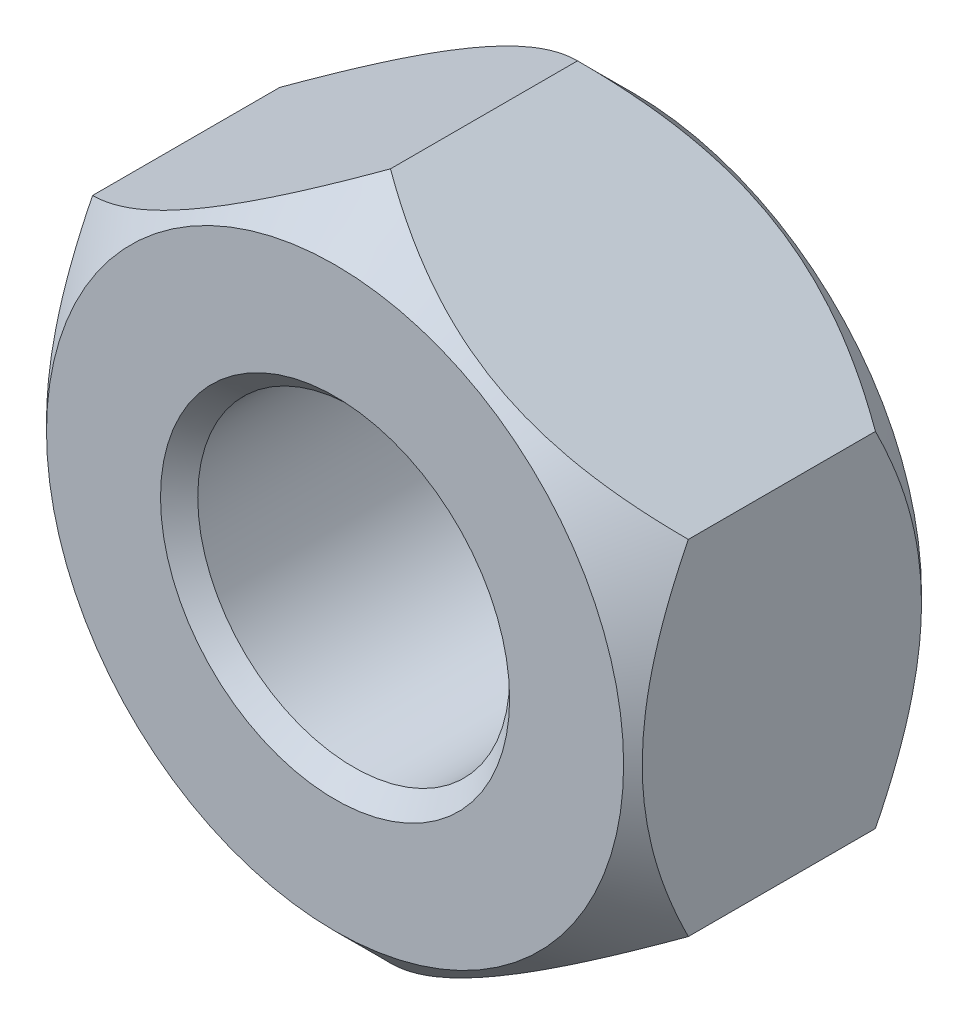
ISO-10303-21;
HEADER;
FILE_DESCRIPTION(('STEP AP214'),'2;1');
FILE_NAME('part.step','',(''),(''),'','','');
FILE_SCHEMA(('AUTOMOTIVE_DESIGN { 1 0 10303 214 1 1 1 1 }'));
ENDSEC;
DATA;
#1=APPLICATION_CONTEXT('core data for automotive mechanical design processes');
#2=APPLICATION_PROTOCOL_DEFINITION('international standard','automotive_design',2000,#1);
#3=PRODUCT_CONTEXT('',#1,'mechanical');
#4=PRODUCT('Part','Part','',(#3));
#5=PRODUCT_RELATED_PRODUCT_CATEGORY('part','',(#4));
#6=PRODUCT_DEFINITION_FORMATION('','',#4);
#7=PRODUCT_DEFINITION_CONTEXT('part definition',#1,'design');
#8=PRODUCT_DEFINITION('design','',#6,#7);
#9=PRODUCT_DEFINITION_SHAPE('','',#8);
#10=(LENGTH_UNIT() NAMED_UNIT(*) SI_UNIT(.MILLI.,.METRE.));
#11=(NAMED_UNIT(*) PLANE_ANGLE_UNIT() SI_UNIT($,.RADIAN.));
#12=(NAMED_UNIT(*) SI_UNIT($,.STERADIAN.) SOLID_ANGLE_UNIT());
#13=UNCERTAINTY_MEASURE_WITH_UNIT(LENGTH_MEASURE(1.E-05),#10,'distance_accuracy_value','');
#14=(GEOMETRIC_REPRESENTATION_CONTEXT(3) GLOBAL_UNCERTAINTY_ASSIGNED_CONTEXT((#13)) GLOBAL_UNIT_ASSIGNED_CONTEXT((#10,
#11,#12)) REPRESENTATION_CONTEXT('',''));
#15=CARTESIAN_POINT('',(0.,0.,0.));
#16=DIRECTION('',(0.,0.,1.));
#17=DIRECTION('',(1.,0.,0.));
#18=AXIS2_PLACEMENT_3D('',#15,#16,#17);
#19=CARTESIAN_POINT('',(0.,0.,-4.));
#20=DIRECTION('',(0.,0.,1.));
#21=DIRECTION('',(1.,0.,0.));
#22=AXIS2_PLACEMENT_3D('',#19,#20,#21);
#23=PLANE('',#22);
#24=CARTESIAN_POINT('',(0.,0.,-4.));
#25=DIRECTION('',(0.,0.,1.));
#26=DIRECTION('',(1.,0.,0.));
#27=AXIS2_PLACEMENT_3D('',#24,#25,#26);
#28=CIRCLE('',#27,4.68800000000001);
#29=CARTESIAN_POINT('',(4.68800000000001,0.,-4.));
#30=VERTEX_POINT('',#29);
#31=EDGE_CURVE('E147',#30,#30,#28,.T.);
#32=ORIENTED_EDGE('',*,*,#31,.T.);
#33=EDGE_LOOP('',(#32));
#34=FACE_BOUND('',#33,.T.);
#35=CARTESIAN_POINT('',(0.,0.,-4.));
#36=DIRECTION('',(0.,0.,1.));
#37=DIRECTION('',(1.,0.,0.));
#38=AXIS2_PLACEMENT_3D('',#35,#36,#37);
#39=CIRCLE('',#38,7.75);
#40=CARTESIAN_POINT('',(7.75,0.,-4.));
#41=VERTEX_POINT('',#40);
#42=EDGE_CURVE('E111',#41,#41,#39,.T.);
#43=ORIENTED_EDGE('',*,*,#42,.F.);
#44=EDGE_LOOP('',(#43));
#45=FACE_BOUND('',#44,.T.);
#46=ADVANCED_FACE('F51',(#34,#45),#23,.F.);
#47=CARTESIAN_POINT('',(0.,0.,4.));
#48=DIRECTION('',(0.,0.,1.));
#49=DIRECTION('',(1.,0.,0.));
#50=AXIS2_PLACEMENT_3D('',#47,#48,#49);
#51=PLANE('',#50);
#52=CARTESIAN_POINT('',(0.,0.,4.));
#53=DIRECTION('',(0.,0.,1.));
#54=DIRECTION('',(1.,0.,0.));
#55=AXIS2_PLACEMENT_3D('',#52,#53,#54);
#56=CIRCLE('',#55,4.688);
#57=CARTESIAN_POINT('',(4.688,0.,4.));
#58=VERTEX_POINT('',#57);
#59=EDGE_CURVE('E12',#58,#58,#56,.F.);
#60=ORIENTED_EDGE('',*,*,#59,.T.);
#61=EDGE_LOOP('',(#60));
#62=FACE_BOUND('',#61,.T.);
#63=CARTESIAN_POINT('',(0.,0.,4.));
#64=DIRECTION('',(0.,0.,1.));
#65=DIRECTION('',(1.,0.,0.));
#66=AXIS2_PLACEMENT_3D('',#63,#64,#65);
#67=CIRCLE('',#66,7.75);
#68=CARTESIAN_POINT('',(7.75,0.,4.));
#69=VERTEX_POINT('',#68);
#70=EDGE_CURVE('E231',#69,#69,#67,.T.);
#71=ORIENTED_EDGE('',*,*,#70,.T.);
#72=EDGE_LOOP('',(#71));
#73=FACE_BOUND('',#72,.T.);
#74=ADVANCED_FACE('F235',(#62,#73),#51,.T.);
#75=CARTESIAN_POINT('',(0.,9.23760430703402,4.));
#76=DIRECTION('',(0.5,-0.866025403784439,0.));
#77=DIRECTION('',(0.866025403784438,0.5,0.));
#78=AXIS2_PLACEMENT_3D('',#75,#76,#77);
#79=PLANE('',#78);
#80=DIRECTION('',(0.,0.,-1.));
#81=VECTOR('',#80,1.);
#82=CARTESIAN_POINT('',(0.,9.23760430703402,4.));
#83=LINE('',#82,#81);
#84=CARTESIAN_POINT('',(0.,9.23760430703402,2.51239569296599));
#85=VERTEX_POINT('',#84);
#86=CARTESIAN_POINT('',(0.,9.23760430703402,-2.51239569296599));
#87=VERTEX_POINT('',#86);
#88=EDGE_CURVE('E124',#85,#87,#83,.T.);
#89=ORIENTED_EDGE('',*,*,#88,.T.);
#90=CARTESIAN_POINT('',(0.000200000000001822,9.23771977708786,-2.51228022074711));
#91=CARTESIAN_POINT('',(-0.137352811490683,9.15830362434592,-2.59168743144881));
#92=CARTESIAN_POINT('',(-0.275962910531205,9.07827704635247,-2.66865771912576));
#93=CARTESIAN_POINT('',(-0.555505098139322,8.91688328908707,-2.81698316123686));
#94=CARTESIAN_POINT('',(-0.696438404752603,8.83551540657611,-2.88833524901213));
#95=CARTESIAN_POINT('',(-1.12434348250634,8.58846429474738,-3.09346070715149));
#96=CARTESIAN_POINT('',(-1.41493761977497,8.42068969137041,-3.21742824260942));
#97=CARTESIAN_POINT('',(-2.00094388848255,8.08235881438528,-3.42971394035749));
#98=CARTESIAN_POINT('',(-2.29620625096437,7.91188900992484,-3.5185669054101));
#99=CARTESIAN_POINT('',(-2.74395385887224,7.65338180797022,-3.62134783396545));
#100=CARTESIAN_POINT('',(-2.89386225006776,7.5668321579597,-3.65051131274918));
#101=CARTESIAN_POINT('',(-3.19494827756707,7.39300005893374,-3.69801217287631));
#102=CARTESIAN_POINT('',(-3.34612572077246,7.30571772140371,-3.71635117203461));
#103=CARTESIAN_POINT('',(-3.7145273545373,7.09302093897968,-3.7470993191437));
#104=CARTESIAN_POINT('',(-3.93214848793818,6.96737731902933,-3.75355065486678));
#105=CARTESIAN_POINT('',(-4.36699849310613,6.7163165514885,-3.74272107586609));
#106=CARTESIAN_POINT('',(-4.58422720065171,6.59089949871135,-3.72543184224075));
#107=CARTESIAN_POINT('',(-5.01663658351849,6.34124782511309,-3.66814025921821));
#108=CARTESIAN_POINT('',(-5.23181469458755,6.21701468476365,-3.62811251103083));
#109=CARTESIAN_POINT('',(-5.65847251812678,5.97068367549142,-3.52752005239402));
#110=CARTESIAN_POINT('',(-5.86995251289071,5.84858564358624,-3.46695691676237));
#111=CARTESIAN_POINT('',(-6.24536139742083,5.6318432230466,-3.34236205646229));
#112=CARTESIAN_POINT('',(-6.41012167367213,5.53671883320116,-3.28160757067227));
#113=CARTESIAN_POINT('',(-6.7366846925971,5.34817758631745,-3.15030853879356));
#114=CARTESIAN_POINT('',(-6.89848734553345,5.25476078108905,-3.07976369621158));
#115=CARTESIAN_POINT('',(-7.21862548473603,5.06992894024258,-2.93046522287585));
#116=CARTESIAN_POINT('',(-7.37697007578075,4.97850864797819,-2.85173740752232));
#117=CARTESIAN_POINT('',(-7.69072726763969,4.79736084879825,-2.68710651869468));
#118=CARTESIAN_POINT('',(-7.84614159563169,4.70763234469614,-2.6012078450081));
#119=CARTESIAN_POINT('',(-8.00020000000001,4.61868668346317,-2.51228022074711));
#120=B_SPLINE_CURVE_WITH_KNOTS('',3,(#90,#91,#92,#93,#94,#95,#96,#97,#98,#99,#100,#101,#102,
#103,#104,#105,#106,#107,#108,#109,#110,#111,#112,#113,#114,#115,#116,#117,#118,#119),
.UNSPECIFIED.,.F.,.F.,(4,2,2,2,2,2,2,2,2,2,2,2,2,2,4),(0.,0.532696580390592,1.06568194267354,
2.13740664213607,3.19211397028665,3.71843331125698,4.24467396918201,4.99761238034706,
5.75081469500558,6.50485999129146,7.25884747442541,7.85770857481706,8.45658781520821,
9.05363199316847,9.65031250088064),.UNSPECIFIED.);
#121=CARTESIAN_POINT('',(-8.00000000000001,4.61880215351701,-2.51239569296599));
#122=VERTEX_POINT('',#121);
#123=EDGE_CURVE('E67',#87,#122,#120,.T.);
#124=ORIENTED_EDGE('',*,*,#123,.T.);
#125=DIRECTION('',(0.,0.,-1.));
#126=VECTOR('',#125,1.);
#127=CARTESIAN_POINT('',(-8.00000000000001,4.61880215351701,4.));
#128=LINE('',#127,#126);
#129=CARTESIAN_POINT('',(-8.00000000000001,4.61880215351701,2.51239569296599));
#130=VERTEX_POINT('',#129);
#131=EDGE_CURVE('E137',#130,#122,#128,.T.);
#132=ORIENTED_EDGE('',*,*,#131,.F.);
#133=CARTESIAN_POINT('',(0.000200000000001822,9.23771977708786,2.51228022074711));
#134=CARTESIAN_POINT('',(-0.137352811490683,9.15830362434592,2.59168743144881));
#135=CARTESIAN_POINT('',(-0.275962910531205,9.07827704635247,2.66865771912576));
#136=CARTESIAN_POINT('',(-0.555505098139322,8.91688328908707,2.81698316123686));
#137=CARTESIAN_POINT('',(-0.696438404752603,8.83551540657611,2.88833524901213));
#138=CARTESIAN_POINT('',(-1.12434348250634,8.58846429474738,3.09346070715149));
#139=CARTESIAN_POINT('',(-1.41493761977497,8.42068969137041,3.21742824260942));
#140=CARTESIAN_POINT('',(-2.00094388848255,8.08235881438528,3.42971394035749));
#141=CARTESIAN_POINT('',(-2.29620625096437,7.91188900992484,3.5185669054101));
#142=CARTESIAN_POINT('',(-2.74395385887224,7.65338180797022,3.62134783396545));
#143=CARTESIAN_POINT('',(-2.89386225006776,7.5668321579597,3.65051131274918));
#144=CARTESIAN_POINT('',(-3.19494827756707,7.39300005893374,3.69801217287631));
#145=CARTESIAN_POINT('',(-3.34612572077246,7.30571772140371,3.71635117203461));
#146=CARTESIAN_POINT('',(-3.7145273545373,7.09302093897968,3.7470993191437));
#147=CARTESIAN_POINT('',(-3.93214848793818,6.96737731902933,3.75355065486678));
#148=CARTESIAN_POINT('',(-4.36699849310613,6.7163165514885,3.74272107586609));
#149=CARTESIAN_POINT('',(-4.58422720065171,6.59089949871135,3.72543184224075));
#150=CARTESIAN_POINT('',(-5.01663658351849,6.34124782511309,3.66814025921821));
#151=CARTESIAN_POINT('',(-5.23181469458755,6.21701468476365,3.62811251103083));
#152=CARTESIAN_POINT('',(-5.65847251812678,5.97068367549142,3.52752005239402));
#153=CARTESIAN_POINT('',(-5.86995251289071,5.84858564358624,3.46695691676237));
#154=CARTESIAN_POINT('',(-6.24536139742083,5.6318432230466,3.34236205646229));
#155=CARTESIAN_POINT('',(-6.41012167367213,5.53671883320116,3.28160757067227));
#156=CARTESIAN_POINT('',(-6.7366846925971,5.34817758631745,3.15030853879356));
#157=CARTESIAN_POINT('',(-6.89848734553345,5.25476078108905,3.07976369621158));
#158=CARTESIAN_POINT('',(-7.21862548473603,5.06992894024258,2.93046522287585));
#159=CARTESIAN_POINT('',(-7.37697007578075,4.97850864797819,2.85173740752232));
#160=CARTESIAN_POINT('',(-7.69072726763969,4.79736084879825,2.68710651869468));
#161=CARTESIAN_POINT('',(-7.84614159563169,4.70763234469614,2.6012078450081));
#162=CARTESIAN_POINT('',(-8.00020000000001,4.61868668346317,2.51228022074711));
#163=B_SPLINE_CURVE_WITH_KNOTS('',3,(#133,#134,#135,#136,#137,#138,#139,#140,#141,#142,#143,
#144,#145,#146,#147,#148,#149,#150,#151,#152,#153,#154,#155,#156,#157,#158,#159,#160,#161,#162),
.UNSPECIFIED.,.F.,.F.,(4,2,2,2,2,2,2,2,2,2,2,2,2,2,4),(0.,0.532696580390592,1.06568194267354,
2.13740664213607,3.19211397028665,3.71843331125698,4.24467396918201,4.99761238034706,
5.75081469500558,6.50485999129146,7.25884747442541,7.85770857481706,8.45658781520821,
9.05363199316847,9.65031250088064),.UNSPECIFIED.);
#164=EDGE_CURVE('E128',#85,#130,#163,.T.);
#165=ORIENTED_EDGE('',*,*,#164,.F.);
#166=EDGE_LOOP('',(#89,#124,#132,#165));
#167=FACE_BOUND('',#166,.T.);
#168=ADVANCED_FACE('F232',(#167),#79,.F.);
#169=CARTESIAN_POINT('',(-8.00000000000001,4.61880215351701,4.));
#170=DIRECTION('',(1.,0.,0.));
#171=DIRECTION('',(0.,0.,-1.));
#172=AXIS2_PLACEMENT_3D('',#169,#170,#171);
#173=PLANE('',#172);
#174=ORIENTED_EDGE('',*,*,#131,.T.);
#175=CARTESIAN_POINT('',(-8.00000000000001,16.677021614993,6.74656859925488));
#176=CARTESIAN_POINT('',(-8.00000000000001,16.4339140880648,6.52737969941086));
#177=CARTESIAN_POINT('',(-8.00000000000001,16.1903653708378,6.30868106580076));
#178=CARTESIAN_POINT('',(-8.00000000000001,15.7022653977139,5.87240492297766));
#179=CARTESIAN_POINT('',(-8.00000000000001,15.4577141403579,5.65482741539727));
#180=CARTESIAN_POINT('',(-8.00000000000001,14.7222298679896,5.00385786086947));
#181=CARTESIAN_POINT('',(-8.00000000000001,14.2296125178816,4.57236086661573));
#182=CARTESIAN_POINT('',(-8.00000000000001,13.4838633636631,3.9279720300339));
#183=CARTESIAN_POINT('',(-8.00000000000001,13.232881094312,3.71259088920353));
#184=CARTESIAN_POINT('',(-8.00000000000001,12.7292285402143,3.28382097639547));
#185=CARTESIAN_POINT('',(-8.00000000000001,12.4765582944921,3.07043215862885));
#186=CARTESIAN_POINT('',(-8.00000000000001,11.969320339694,2.64601838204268));
#187=CARTESIAN_POINT('',(-8.00000000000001,11.7147530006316,2.43499298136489));
#188=CARTESIAN_POINT('',(-8.00000000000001,11.2033461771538,2.01566479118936));
#189=CARTESIAN_POINT('',(-8.00000000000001,10.9465064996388,1.80736223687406));
#190=CARTESIAN_POINT('',(-8.00000000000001,10.4555553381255,1.41431471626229));
#191=CARTESIAN_POINT('',(-8.00000000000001,10.221688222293,1.22926479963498));
#192=CARTESIAN_POINT('',(-8.00000000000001,9.75150464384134,0.862304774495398));
#193=CARTESIAN_POINT('',(-8.00000000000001,9.51518821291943,0.680394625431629));
#194=CARTESIAN_POINT('',(-8.00000000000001,9.03974665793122,0.320332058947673));
#195=CARTESIAN_POINT('',(-8.00000000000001,8.80062185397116,0.142179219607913));
#196=CARTESIAN_POINT('',(-8.00000000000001,8.3190909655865,-0.209625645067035));
#197=CARTESIAN_POINT('',(-8.00000000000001,8.07668501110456,-0.383277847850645));
#198=CARTESIAN_POINT('',(-8.00000000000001,7.58855538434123,-0.724764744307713));
#199=CARTESIAN_POINT('',(-8.00000000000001,7.34283973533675,-0.892610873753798));
#200=CARTESIAN_POINT('',(-8.00000000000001,6.84695249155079,-1.22164145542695));
#201=CARTESIAN_POINT('',(-8.00000000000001,6.59678066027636,-1.3828255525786));
#202=CARTESIAN_POINT('',(-8.00000000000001,6.09146673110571,-1.6968017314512));
#203=CARTESIAN_POINT('',(-8.00000000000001,5.8363285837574,-1.84960014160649));
#204=CARTESIAN_POINT('',(-8.00000000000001,5.32014433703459,-2.14483941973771));
#205=CARTESIAN_POINT('',(-8.00000000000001,5.05909922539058,-2.28728200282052));
#206=CARTESIAN_POINT('',(-8.00000000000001,4.54613837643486,-2.55098167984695));
#207=CARTESIAN_POINT('',(-8.00000000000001,4.29461515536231,-2.6729972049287));
#208=CARTESIAN_POINT('',(-8.00000000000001,3.78502505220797,-2.90270124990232));
#209=CARTESIAN_POINT('',(-8.00000000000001,3.52695772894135,-3.01038880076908));
#210=CARTESIAN_POINT('',(-8.00000000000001,3.00465775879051,-3.20777100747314));
#211=CARTESIAN_POINT('',(-8.00000000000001,2.74044127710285,-3.2975079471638));
#212=CARTESIAN_POINT('',(-8.00000000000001,2.20566966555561,-3.45543221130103));
#213=CARTESIAN_POINT('',(-8.00000000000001,1.93511771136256,-3.52363009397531));
#214=CARTESIAN_POINT('',(-8.00000000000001,1.43173596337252,-3.62602007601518));
#215=CARTESIAN_POINT('',(-8.00000000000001,1.19965471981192,-3.66387063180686));
#216=CARTESIAN_POINT('',(-8.00000000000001,0.733117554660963,-3.71981438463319));
#217=CARTESIAN_POINT('',(-8.00000000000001,0.498662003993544,-3.73791062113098));
#218=CARTESIAN_POINT('',(-8.00000000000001,0.0293362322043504,-3.75337981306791));
#219=CARTESIAN_POINT('',(-8.00000000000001,-0.20553316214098,-3.75077743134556));
#220=CARTESIAN_POINT('',(-8.00000000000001,-0.674150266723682,-3.72505822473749));
#221=CARTESIAN_POINT('',(-8.00000000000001,-0.907897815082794,-3.70193852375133));
#222=CARTESIAN_POINT('',(-8.00000000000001,-1.43154362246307,-3.62803927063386));
#223=CARTESIAN_POINT('',(-8.00000000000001,-1.72066391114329,-3.57173596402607));
#224=CARTESIAN_POINT('',(-8.00000000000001,-2.29243442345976,-3.43265983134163));
#225=CARTESIAN_POINT('',(-8.00000000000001,-2.57508184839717,-3.34987577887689));
#226=CARTESIAN_POINT('',(-8.00000000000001,-3.13438779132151,-3.16195065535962));
#227=CARTESIAN_POINT('',(-8.00000000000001,-3.41100765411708,-3.05669587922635));
#228=CARTESIAN_POINT('',(-8.00000000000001,-3.82023953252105,-2.88552645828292));
#229=CARTESIAN_POINT('',(-8.00000000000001,-3.95569575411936,-2.82625780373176));
#230=CARTESIAN_POINT('',(-8.00000000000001,-4.224803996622,-2.70375120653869));
#231=CARTESIAN_POINT('',(-8.00000000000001,-4.35845602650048,-2.64051328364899));
#232=CARTESIAN_POINT('',(-8.00000000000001,-4.70447797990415,-2.47112539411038));
#233=CARTESIAN_POINT('',(-8.00000000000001,-4.91548376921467,-2.36218803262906));
#234=CARTESIAN_POINT('',(-8.00000000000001,-5.3334340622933,-2.13675103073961));
#235=CARTESIAN_POINT('',(-8.00000000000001,-5.5403778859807,-2.02025013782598));
#236=CARTESIAN_POINT('',(-8.00000000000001,-5.95070781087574,-1.78089074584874));
#237=CARTESIAN_POINT('',(-8.00000000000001,-6.1540917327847,-1.65802852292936));
#238=CARTESIAN_POINT('',(-8.00000000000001,-6.55758851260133,-1.40703045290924));
#239=CARTESIAN_POINT('',(-8.00000000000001,-6.75770113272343,-1.27889422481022));
#240=CARTESIAN_POINT('',(-8.00000000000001,-7.15549781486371,-1.01787241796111));
#241=CARTESIAN_POINT('',(-8.00000000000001,-7.35317474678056,-0.884975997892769));
#242=CARTESIAN_POINT('',(-8.00000000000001,-7.7459392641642,-0.615404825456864));
#243=CARTESIAN_POINT('',(-8.00000000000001,-7.94102675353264,-0.478729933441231));
#244=CARTESIAN_POINT('',(-8.00000000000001,-8.52272092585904,-0.0639991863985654));
#245=CARTESIAN_POINT('',(-8.00000000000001,-8.90590512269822,0.218859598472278));
#246=CARTESIAN_POINT('',(-8.00000000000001,-9.66681344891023,0.795337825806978));
#247=CARTESIAN_POINT('',(-8.00000000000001,-10.0445044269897,1.08900071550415));
#248=CARTESIAN_POINT('',(-8.00000000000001,-10.7941449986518,1.68359546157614));
#249=CARTESIAN_POINT('',(-8.00000000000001,-11.1660942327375,1.98452777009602));
#250=CARTESIAN_POINT('',(-8.00000000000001,-11.9048648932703,2.59160363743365));
#251=CARTESIAN_POINT('',(-8.00000000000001,-12.2716925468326,2.89773963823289));
#252=CARTESIAN_POINT('',(-8.00000000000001,-13.0015844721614,3.51444067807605));
#253=CARTESIAN_POINT('',(-8.00000000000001,-13.3646488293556,3.82500561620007));
#254=CARTESIAN_POINT('',(-8.00000000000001,-14.2245738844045,4.56794628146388));
#255=CARTESIAN_POINT('',(-8.00000000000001,-14.7200495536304,5.00192429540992));
#256=CARTESIAN_POINT('',(-8.00000000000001,-15.458283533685,5.65533325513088));
#257=CARTESIAN_POINT('',(-8.00000000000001,-15.7027522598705,5.87283891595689));
#258=CARTESIAN_POINT('',(-8.00000000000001,-16.1906346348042,6.30892291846));
#259=CARTESIAN_POINT('',(-8.00000000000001,-16.4340485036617,6.52750101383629));
#260=CARTESIAN_POINT('',(-8.00000000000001,-16.677021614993,6.74656859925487));
#261=B_SPLINE_CURVE_WITH_KNOTS('',3,(#175,#176,#177,#178,#179,#180,#181,#182,#183,#184,#185,
#186,#187,#188,#189,#190,#191,#192,#193,#194,#195,#196,#197,#198,#199,#200,#201,#202,#203,#204,
#205,#206,#207,#208,#209,#210,#211,#212,#213,#214,#215,#216,#217,#218,#219,#220,#221,#222,#223,
#224,#225,#226,#227,#228,#229,#230,#231,#232,#233,#234,#235,#236,#237,#238,#239,#240,#241,#242,
#243,#244,#245,#246,#247,#248,#249,#250,#251,#252,#253,#254,#255,#256,#257,#258,#259,#260),
.UNSPECIFIED.,.F.,.F.,(4,2,2,2,2,2,2,2,2,2,2,2,2,2,2,2,2,2,2,2,2,2,2,2,2,2,2,2,2,2,2,2,2,2,2,2,
2,2,2,2,2,2,4),(0.,0.98198814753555,1.96397772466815,3.92854786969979,4.92072454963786,
5.9128783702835,6.90484349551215,7.89689374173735,8.79154219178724,9.68617907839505,
10.5807149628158,11.4752155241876,12.3678403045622,13.2605125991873,14.1525016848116,
15.044342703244,15.8826525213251,16.7210190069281,17.5573867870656,18.393343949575,
19.0980187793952,19.802585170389,20.5063121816,21.2101378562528,22.0922820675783,
22.9748007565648,23.8618956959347,24.305411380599,24.7489248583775,25.4611294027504,
26.1734521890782,26.8861967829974,27.5989929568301,28.313531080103,29.0280956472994,
30.4566999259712,31.8918641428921,33.3271178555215,34.7604400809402,36.193729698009,
38.1696568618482,39.1513179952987,40.1327633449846),.UNSPECIFIED.);
#262=CARTESIAN_POINT('',(-8.00000000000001,-4.61880215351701,-2.51239569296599));
#263=VERTEX_POINT('',#262);
#264=EDGE_CURVE('E216',#122,#263,#261,.T.);
#265=ORIENTED_EDGE('',*,*,#264,.T.);
#266=DIRECTION('',(0.,0.,-1.));
#267=VECTOR('',#266,1.);
#268=CARTESIAN_POINT('',(-8.00000000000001,-4.61880215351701,4.));
#269=LINE('',#268,#267);
#270=CARTESIAN_POINT('',(-8.00000000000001,-4.61880215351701,2.51239569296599));
#271=VERTEX_POINT('',#270);
#272=EDGE_CURVE('E134',#271,#263,#269,.T.);
#273=ORIENTED_EDGE('',*,*,#272,.F.);
#274=CARTESIAN_POINT('',(-8.00000000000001,16.6323065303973,-6.70626236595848));
#275=CARTESIAN_POINT('',(-8.00000000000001,16.3898767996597,-6.48779457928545));
#276=CARTESIAN_POINT('',(-8.00000000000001,16.1470054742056,-6.26981775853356));
#277=CARTESIAN_POINT('',(-8.00000000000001,15.6602594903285,-5.8349867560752));
#278=CARTESIAN_POINT('',(-8.00000000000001,15.4163848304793,-5.61813257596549));
#279=CARTESIAN_POINT('',(-8.00000000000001,14.6829283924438,-4.96933482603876));
#280=CARTESIAN_POINT('',(-8.00000000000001,14.1916610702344,-4.53928874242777));
#281=CARTESIAN_POINT('',(-8.00000000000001,13.4479083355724,-3.89706020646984));
#282=CARTESIAN_POINT('',(-8.00000000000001,13.1975731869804,-3.68238591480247));
#283=CARTESIAN_POINT('',(-8.00000000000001,12.6952139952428,-3.25503230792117));
#284=CARTESIAN_POINT('',(-8.00000000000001,12.4431899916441,-3.04235294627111));
#285=CARTESIAN_POINT('',(-8.00000000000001,11.9372441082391,-2.61936111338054));
#286=CARTESIAN_POINT('',(-8.00000000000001,11.683322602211,-2.40904819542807));
#287=CARTESIAN_POINT('',(-8.00000000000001,11.1732067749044,-1.9911477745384));
#288=CARTESIAN_POINT('',(-8.00000000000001,10.9170122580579,-1.78356051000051));
#289=CARTESIAN_POINT('',(-8.00000000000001,10.4267508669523,-1.39144657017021));
#290=CARTESIAN_POINT('',(-8.00000000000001,10.1929234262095,-1.20662081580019));
#291=CARTESIAN_POINT('',(-8.00000000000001,9.7228076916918,-0.840127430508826));
#292=CARTESIAN_POINT('',(-8.00000000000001,9.48651943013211,-0.658459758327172));
#293=CARTESIAN_POINT('',(-8.00000000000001,9.01112097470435,-0.298905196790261));
#294=CARTESIAN_POINT('',(-8.00000000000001,8.77201110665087,-0.121017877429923));
#295=CARTESIAN_POINT('',(-8.00000000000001,8.2904943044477,0.230227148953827));
#296=CARTESIAN_POINT('',(-8.00000000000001,8.04808750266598,0.403585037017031));
#297=CARTESIAN_POINT('',(-8.00000000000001,7.55994843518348,0.744439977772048));
#298=CARTESIAN_POINT('',(-8.00000000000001,7.31422439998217,0.911948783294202));
#299=CARTESIAN_POINT('',(-8.00000000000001,6.8182995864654,1.24025896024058));
#300=CARTESIAN_POINT('',(-8.00000000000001,6.56809856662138,1.4010599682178));
#301=CARTESIAN_POINT('',(-8.00000000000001,6.06270653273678,1.71420953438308));
#302=CARTESIAN_POINT('',(-8.00000000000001,5.80751954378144,1.86656455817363));
#303=CARTESIAN_POINT('',(-8.00000000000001,5.29121549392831,2.16084138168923));
#304=CARTESIAN_POINT('',(-8.00000000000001,5.0300994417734,2.30276493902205));
#305=CARTESIAN_POINT('',(-8.00000000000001,4.51724020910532,2.56523300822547));
#306=CARTESIAN_POINT('',(-8.00000000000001,4.26589686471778,2.6865535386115));
#307=CARTESIAN_POINT('',(-8.00000000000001,3.75667190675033,2.91479819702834));
#308=CARTESIAN_POINT('',(-8.00000000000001,3.49878986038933,3.02172136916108));
#309=CARTESIAN_POINT('',(-8.00000000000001,2.97689531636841,3.21749944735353));
#310=CARTESIAN_POINT('',(-8.00000000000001,2.71289927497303,3.30639771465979));
#311=CARTESIAN_POINT('',(-8.00000000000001,2.17861536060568,3.46258572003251));
#312=CARTESIAN_POINT('',(-8.00000000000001,1.90833063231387,3.52988601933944));
#313=CARTESIAN_POINT('',(-8.00000000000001,1.40513787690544,3.63067268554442));
#314=CARTESIAN_POINT('',(-8.00000000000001,1.17296181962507,3.66779212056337));
#315=CARTESIAN_POINT('',(-8.00000000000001,0.706294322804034,3.72222328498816));
#316=CARTESIAN_POINT('',(-8.00000000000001,0.471803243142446,3.73953804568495));
#317=CARTESIAN_POINT('',(-8.00000000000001,0.00246038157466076,3.75343456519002));
#318=CARTESIAN_POINT('',(-8.00000000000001,-0.232390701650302,3.75003953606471));
#319=CARTESIAN_POINT('',(-8.00000000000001,-0.700905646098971,3.72276351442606));
#320=CARTESIAN_POINT('',(-8.00000000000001,-0.934569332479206,3.69887958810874));
#321=CARTESIAN_POINT('',(-8.00000000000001,-1.45928197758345,3.6231413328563));
#322=CARTESIAN_POINT('',(-8.00000000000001,-1.74951614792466,3.5656440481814));
#323=CARTESIAN_POINT('',(-8.00000000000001,-2.32349203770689,3.42407444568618));
#324=CARTESIAN_POINT('',(-8.00000000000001,-2.60722956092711,3.33998544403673));
#325=CARTESIAN_POINT('',(-8.00000000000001,-3.02787447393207,3.19719404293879));
#326=CARTESIAN_POINT('',(-8.00000000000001,-3.16763613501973,3.14666012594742));
#327=CARTESIAN_POINT('',(-8.00000000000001,-3.44520120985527,3.04063882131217));
#328=CARTESIAN_POINT('',(-8.00000000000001,-3.5830054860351,2.98515369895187));
#329=CARTESIAN_POINT('',(-8.00000000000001,-3.85672207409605,2.86974652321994));
#330=CARTESIAN_POINT('',(-8.00000000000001,-3.99263453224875,2.80982481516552));
#331=CARTESIAN_POINT('',(-8.00000000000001,-4.26265574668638,2.68601406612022));
#332=CARTESIAN_POINT('',(-8.00000000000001,-4.39676426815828,2.62212451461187));
#333=CARTESIAN_POINT('',(-8.00000000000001,-4.7457188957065,2.45018366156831));
#334=CARTESIAN_POINT('',(-8.00000000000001,-4.95915915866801,2.33927509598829));
#335=CARTESIAN_POINT('',(-8.00000000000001,-5.38190307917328,2.10980450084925));
#336=CARTESIAN_POINT('',(-8.00000000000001,-5.59120601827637,1.99124115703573));
#337=CARTESIAN_POINT('',(-8.00000000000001,-6.00618748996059,1.74769773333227));
#338=CARTESIAN_POINT('',(-8.00000000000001,-6.21186396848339,1.62271416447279));
#339=CARTESIAN_POINT('',(-8.00000000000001,-6.61990014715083,1.36743039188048));
#340=CARTESIAN_POINT('',(-8.00000000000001,-6.8222596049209,1.23712980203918));
#341=CARTESIAN_POINT('',(-8.00000000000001,-7.22452538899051,0.971741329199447));
#342=CARTESIAN_POINT('',(-8.00000000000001,-7.42442442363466,0.836642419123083));
#343=CARTESIAN_POINT('',(-8.00000000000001,-7.82160605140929,0.562646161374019));
#344=CARTESIAN_POINT('',(-8.00000000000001,-8.01888854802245,0.423748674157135));
#345=CARTESIAN_POINT('',(-8.00000000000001,-8.60713885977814,0.00232993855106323));
#346=CARTESIAN_POINT('',(-8.00000000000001,-8.99465361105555,-0.285013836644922));
#347=CARTESIAN_POINT('',(-8.00000000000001,-9.76411996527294,-0.870443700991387));
#348=CARTESIAN_POINT('',(-8.00000000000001,-10.1460396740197,-1.16857141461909));
#349=CARTESIAN_POINT('',(-8.00000000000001,-10.904114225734,-1.77209762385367));
#350=CARTESIAN_POINT('',(-8.00000000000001,-11.2802687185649,-2.07749655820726));
#351=CARTESIAN_POINT('',(-8.00000000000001,-12.0274350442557,-2.69349660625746));
#352=CARTESIAN_POINT('',(-8.00000000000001,-12.3984530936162,-3.00409019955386));
#353=CARTESIAN_POINT('',(-8.00000000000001,-13.1367222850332,-3.62969784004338));
#354=CARTESIAN_POINT('',(-8.00000000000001,-13.503973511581,-3.94471178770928));
#355=CARTESIAN_POINT('',(-8.00000000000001,-14.3358068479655,-4.66526822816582));
#356=CARTESIAN_POINT('',(-8.00000000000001,-14.7994277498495,-5.07191963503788));
#357=CARTESIAN_POINT('',(-8.00000000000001,-15.4905460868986,-5.68403970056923));
#358=CARTESIAN_POINT('',(-8.00000000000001,-15.7195317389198,-5.88783340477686));
#359=CARTESIAN_POINT('',(-8.00000000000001,-16.1765769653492,-6.29636128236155));
#360=CARTESIAN_POINT('',(-8.00000000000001,-16.4046367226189,-6.50109525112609));
#361=CARTESIAN_POINT('',(-8.00000000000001,-16.6323065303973,-6.70626236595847));
#362=B_SPLINE_CURVE_WITH_KNOTS('',3,(#274,#275,#276,#277,#278,#279,#280,#281,#282,#283,#284,
#285,#286,#287,#288,#289,#290,#291,#292,#293,#294,#295,#296,#297,#298,#299,#300,#301,#302,#303,
#304,#305,#306,#307,#308,#309,#310,#311,#312,#313,#314,#315,#316,#317,#318,#319,#320,#321,#322,
#323,#324,#325,#326,#327,#328,#329,#330,#331,#332,#333,#334,#335,#336,#337,#338,#339,#340,#341,
#342,#343,#344,#345,#346,#347,#348,#349,#350,#351,#352,#353,#354,#355,#356,#357,#358,#359,#360,
#361),.UNSPECIFIED.,.F.,.F.,(4,2,2,2,2,2,2,2,2,2,2,2,2,2,2,2,2,2,2,2,2,2,2,2,2,2,2,2,2,2,2,2,2,
2,2,2,2,2,2,2,2,2,2,4),(0.,0.979029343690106,1.95806007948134,3.91671543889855,4.9060379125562,
5.89533730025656,6.88444669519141,7.8736420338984,8.76777972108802,9.66190571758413,
10.5559294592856,11.4499174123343,12.3419914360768,13.2341137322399,14.125543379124,
15.0168224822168,15.8537348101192,16.6907026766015,17.5256325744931,18.3601535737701,
19.064754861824,19.7692482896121,20.472952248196,21.1767569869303,22.0628823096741,
22.949564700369,23.3953392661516,23.8409109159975,24.2864479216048,24.7320423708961,
25.4534454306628,26.1749726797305,26.8968962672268,27.6188723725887,28.3426313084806,
29.0664168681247,30.5134683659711,31.966873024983,33.4203656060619,34.8719102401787,
36.3234222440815,38.1734586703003,39.0930744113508,40.012498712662),.UNSPECIFIED.);
#363=EDGE_CURVE('E192',#130,#271,#362,.T.);
#364=ORIENTED_EDGE('',*,*,#363,.F.);
#365=EDGE_LOOP('',(#174,#265,#273,#364));
#366=FACE_BOUND('',#365,.T.);
#367=ADVANCED_FACE('F202',(#366),#173,.F.);
#368=CARTESIAN_POINT('',(-8.00000000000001,-4.61880215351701,4.));
#369=DIRECTION('',(0.5,0.866025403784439,0.));
#370=DIRECTION('',(-0.866025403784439,0.5,0.));
#371=AXIS2_PLACEMENT_3D('',#368,#369,#370);
#372=PLANE('',#371);
#373=ORIENTED_EDGE('',*,*,#272,.T.);
#374=CARTESIAN_POINT('',(-8.00020000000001,-4.61868668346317,-2.51228022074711));
#375=CARTESIAN_POINT('',(-7.86264718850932,-4.69810283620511,-2.59168743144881));
#376=CARTESIAN_POINT('',(-7.7240370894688,-4.77812941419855,-2.66865771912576));
#377=CARTESIAN_POINT('',(-7.44449490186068,-4.93952317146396,-2.81698316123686));
#378=CARTESIAN_POINT('',(-7.3035615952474,-5.02089105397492,-2.88833524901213));
#379=CARTESIAN_POINT('',(-6.87565651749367,-5.26794216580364,-3.09346070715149));
#380=CARTESIAN_POINT('',(-6.58506238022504,-5.43571676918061,-3.21742824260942));
#381=CARTESIAN_POINT('',(-5.99905611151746,-5.77404764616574,-3.42971394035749));
#382=CARTESIAN_POINT('',(-5.70379374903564,-5.94451745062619,-3.5185669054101));
#383=CARTESIAN_POINT('',(-5.25604614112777,-6.20302465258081,-3.62134783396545));
#384=CARTESIAN_POINT('',(-5.10613774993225,-6.28957430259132,-3.65051131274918));
#385=CARTESIAN_POINT('',(-4.80505172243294,-6.46340640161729,-3.69801217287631));
#386=CARTESIAN_POINT('',(-4.65387427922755,-6.55068873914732,-3.71635117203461));
#387=CARTESIAN_POINT('',(-4.28547264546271,-6.76338552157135,-3.7470993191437));
#388=CARTESIAN_POINT('',(-4.06785151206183,-6.8890291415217,-3.75355065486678));
#389=CARTESIAN_POINT('',(-3.63300150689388,-7.14008990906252,-3.74272107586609));
#390=CARTESIAN_POINT('',(-3.4157727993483,-7.26550696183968,-3.72543184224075));
#391=CARTESIAN_POINT('',(-2.98336341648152,-7.51515863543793,-3.66814025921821));
#392=CARTESIAN_POINT('',(-2.76818530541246,-7.63939177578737,-3.62811251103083));
#393=CARTESIAN_POINT('',(-2.34152748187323,-7.88572278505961,-3.52752005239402));
#394=CARTESIAN_POINT('',(-2.13004748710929,-8.00782081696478,-3.46695691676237));
#395=CARTESIAN_POINT('',(-1.75463860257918,-8.22456323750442,-3.34236205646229));
#396=CARTESIAN_POINT('',(-1.58987832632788,-8.31968762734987,-3.28160757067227));
#397=CARTESIAN_POINT('',(-1.26331530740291,-8.50822887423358,-3.15030853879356));
#398=CARTESIAN_POINT('',(-1.10151265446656,-8.60164567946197,-3.07976369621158));
#399=CARTESIAN_POINT('',(-0.781374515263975,-8.78647752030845,-2.93046522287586));
#400=CARTESIAN_POINT('',(-0.623029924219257,-8.87789781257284,-2.85173740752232));
#401=CARTESIAN_POINT('',(-0.309272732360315,-9.05904561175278,-2.68710651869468));
#402=CARTESIAN_POINT('',(-0.153858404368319,-9.14877411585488,-2.6012078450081));
#403=CARTESIAN_POINT('',(0.000200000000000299,-9.23771977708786,-2.51228022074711));
#404=B_SPLINE_CURVE_WITH_KNOTS('',3,(#374,#375,#376,#377,#378,#379,#380,#381,#382,#383,#384,
#385,#386,#387,#388,#389,#390,#391,#392,#393,#394,#395,#396,#397,#398,#399,#400,#401,#402,#403),
.UNSPECIFIED.,.F.,.F.,(4,2,2,2,2,2,2,2,2,2,2,2,2,2,4),(0.,0.532696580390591,1.06568194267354,
2.13740664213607,3.19211397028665,3.71843331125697,4.244673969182,4.99761238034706,
5.75081469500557,6.50485999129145,7.25884747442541,7.85770857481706,8.4565878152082,
9.05363199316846,9.65031250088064),.UNSPECIFIED.);
#405=CARTESIAN_POINT('',(0.,-9.23760430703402,-2.51239569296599));
#406=VERTEX_POINT('',#405);
#407=EDGE_CURVE('E208',#263,#406,#404,.T.);
#408=ORIENTED_EDGE('',*,*,#407,.T.);
#409=DIRECTION('',(0.,0.,-1.));
#410=VECTOR('',#409,1.);
#411=CARTESIAN_POINT('',(0.,-9.23760430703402,4.));
#412=LINE('',#411,#410);
#413=CARTESIAN_POINT('',(0.,-9.23760430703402,2.51239569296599));
#414=VERTEX_POINT('',#413);
#415=EDGE_CURVE('E126',#414,#406,#412,.T.);
#416=ORIENTED_EDGE('',*,*,#415,.F.);
#417=CARTESIAN_POINT('',(-8.00020000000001,-4.61868668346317,2.51228022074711));
#418=CARTESIAN_POINT('',(-7.86264718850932,-4.69810283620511,2.59168743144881));
#419=CARTESIAN_POINT('',(-7.7240370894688,-4.77812941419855,2.66865771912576));
#420=CARTESIAN_POINT('',(-7.44449490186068,-4.93952317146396,2.81698316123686));
#421=CARTESIAN_POINT('',(-7.3035615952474,-5.02089105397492,2.88833524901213));
#422=CARTESIAN_POINT('',(-6.87565651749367,-5.26794216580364,3.09346070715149));
#423=CARTESIAN_POINT('',(-6.58506238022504,-5.43571676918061,3.21742824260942));
#424=CARTESIAN_POINT('',(-5.99905611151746,-5.77404764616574,3.42971394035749));
#425=CARTESIAN_POINT('',(-5.70379374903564,-5.94451745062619,3.5185669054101));
#426=CARTESIAN_POINT('',(-5.25604614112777,-6.20302465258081,3.62134783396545));
#427=CARTESIAN_POINT('',(-5.10613774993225,-6.28957430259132,3.65051131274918));
#428=CARTESIAN_POINT('',(-4.80505172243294,-6.46340640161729,3.69801217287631));
#429=CARTESIAN_POINT('',(-4.65387427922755,-6.55068873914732,3.71635117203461));
#430=CARTESIAN_POINT('',(-4.28547264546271,-6.76338552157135,3.7470993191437));
#431=CARTESIAN_POINT('',(-4.06785151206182,-6.8890291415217,3.75355065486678));
#432=CARTESIAN_POINT('',(-3.63300150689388,-7.14008990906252,3.74272107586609));
#433=CARTESIAN_POINT('',(-3.4157727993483,-7.26550696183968,3.72543184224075));
#434=CARTESIAN_POINT('',(-2.98336341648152,-7.51515863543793,3.66814025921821));
#435=CARTESIAN_POINT('',(-2.76818530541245,-7.63939177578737,3.62811251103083));
#436=CARTESIAN_POINT('',(-2.34152748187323,-7.88572278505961,3.52752005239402));
#437=CARTESIAN_POINT('',(-2.13004748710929,-8.00782081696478,3.46695691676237));
#438=CARTESIAN_POINT('',(-1.75463860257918,-8.22456323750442,3.34236205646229));
#439=CARTESIAN_POINT('',(-1.58987832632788,-8.31968762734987,3.28160757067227));
#440=CARTESIAN_POINT('',(-1.26331530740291,-8.50822887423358,3.15030853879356));
#441=CARTESIAN_POINT('',(-1.10151265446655,-8.60164567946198,3.07976369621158));
#442=CARTESIAN_POINT('',(-0.781374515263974,-8.78647752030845,2.93046522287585));
#443=CARTESIAN_POINT('',(-0.623029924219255,-8.87789781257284,2.85173740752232));
#444=CARTESIAN_POINT('',(-0.309272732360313,-9.05904561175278,2.68710651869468));
#445=CARTESIAN_POINT('',(-0.153858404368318,-9.14877411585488,2.6012078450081));
#446=CARTESIAN_POINT('',(0.000199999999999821,-9.23771977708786,2.51228022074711));
#447=B_SPLINE_CURVE_WITH_KNOTS('',3,(#417,#418,#419,#420,#421,#422,#423,#424,#425,#426,#427,
#428,#429,#430,#431,#432,#433,#434,#435,#436,#437,#438,#439,#440,#441,#442,#443,#444,#445,#446),
.UNSPECIFIED.,.F.,.F.,(4,2,2,2,2,2,2,2,2,2,2,2,2,2,4),(0.,0.532696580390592,1.06568194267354,
2.13740664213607,3.19211397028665,3.71843331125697,4.244673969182,4.99761238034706,
5.75081469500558,6.50485999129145,7.25884747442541,7.85770857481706,8.45658781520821,
9.05363199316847,9.65031250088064),.UNSPECIFIED.);
#448=EDGE_CURVE('E186',#271,#414,#447,.T.);
#449=ORIENTED_EDGE('',*,*,#448,.F.);
#450=EDGE_LOOP('',(#373,#408,#416,#449));
#451=FACE_BOUND('',#450,.T.);
#452=ADVANCED_FACE('F198',(#451),#372,.F.);
#453=CARTESIAN_POINT('',(0.,-9.23760430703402,4.));
#454=DIRECTION('',(-0.5,0.866025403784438,0.));
#455=DIRECTION('',(-0.866025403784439,-0.5,0.));
#456=AXIS2_PLACEMENT_3D('',#453,#454,#455);
#457=PLANE('',#456);
#458=ORIENTED_EDGE('',*,*,#415,.T.);
#459=CARTESIAN_POINT('',(-0.000200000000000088,-9.23771977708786,-2.51228022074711));
#460=CARTESIAN_POINT('',(0.137352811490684,-9.15830362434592,-2.59168743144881));
#461=CARTESIAN_POINT('',(0.275962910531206,-9.07827704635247,-2.66865771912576));
#462=CARTESIAN_POINT('',(0.555505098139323,-8.91688328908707,-2.81698316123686));
#463=CARTESIAN_POINT('',(0.696438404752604,-8.83551540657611,-2.88833524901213));
#464=CARTESIAN_POINT('',(1.12434348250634,-8.58846429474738,-3.09346070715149));
#465=CARTESIAN_POINT('',(1.41493761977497,-8.42068969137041,-3.21742824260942));
#466=CARTESIAN_POINT('',(2.00094388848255,-8.08235881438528,-3.42971394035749));
#467=CARTESIAN_POINT('',(2.29620625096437,-7.91188900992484,-3.5185669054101));
#468=CARTESIAN_POINT('',(2.74395385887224,-7.65338180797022,-3.62134783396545));
#469=CARTESIAN_POINT('',(2.89386225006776,-7.5668321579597,-3.65051131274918));
#470=CARTESIAN_POINT('',(3.19494827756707,-7.39300005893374,-3.69801217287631));
#471=CARTESIAN_POINT('',(3.34612572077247,-7.3057177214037,-3.71635117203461));
#472=CARTESIAN_POINT('',(3.7145273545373,-7.09302093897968,-3.7470993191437));
#473=CARTESIAN_POINT('',(3.93214848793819,-6.96737731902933,-3.75355065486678));
#474=CARTESIAN_POINT('',(4.36699849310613,-6.7163165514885,-3.74272107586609));
#475=CARTESIAN_POINT('',(4.58422720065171,-6.59089949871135,-3.72543184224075));
#476=CARTESIAN_POINT('',(5.01663658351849,-6.34124782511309,-3.66814025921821));
#477=CARTESIAN_POINT('',(5.23181469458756,-6.21701468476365,-3.62811251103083));
#478=CARTESIAN_POINT('',(5.65847251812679,-5.97068367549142,-3.52752005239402));
#479=CARTESIAN_POINT('',(5.86995251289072,-5.84858564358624,-3.46695691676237));
#480=CARTESIAN_POINT('',(6.24536139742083,-5.6318432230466,-3.34236205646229));
#481=CARTESIAN_POINT('',(6.41012167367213,-5.53671883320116,-3.28160757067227));
#482=CARTESIAN_POINT('',(6.7366846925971,-5.34817758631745,-3.15030853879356));
#483=CARTESIAN_POINT('',(6.89848734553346,-5.25476078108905,-3.07976369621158));
#484=CARTESIAN_POINT('',(7.21862548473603,-5.06992894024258,-2.93046522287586));
#485=CARTESIAN_POINT('',(7.37697007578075,-4.97850864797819,-2.85173740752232));
#486=CARTESIAN_POINT('',(7.69072726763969,-4.79736084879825,-2.68710651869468));
#487=CARTESIAN_POINT('',(7.84614159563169,-4.70763234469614,-2.6012078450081));
#488=CARTESIAN_POINT('',(8.00020000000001,-4.61868668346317,-2.51228022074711));
#489=B_SPLINE_CURVE_WITH_KNOTS('',3,(#459,#460,#461,#462,#463,#464,#465,#466,#467,#468,#469,
#470,#471,#472,#473,#474,#475,#476,#477,#478,#479,#480,#481,#482,#483,#484,#485,#486,#487,#488),
.UNSPECIFIED.,.F.,.F.,(4,2,2,2,2,2,2,2,2,2,2,2,2,2,4),(0.,0.532696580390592,1.06568194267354,
2.13740664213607,3.19211397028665,3.71843331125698,4.24467396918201,4.99761238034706,
5.75081469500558,6.50485999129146,7.25884747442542,7.85770857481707,8.45658781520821,
9.05363199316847,9.65031250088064),.UNSPECIFIED.);
#490=CARTESIAN_POINT('',(8.00000000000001,-4.61880215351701,-2.51239569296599));
#491=VERTEX_POINT('',#490);
#492=EDGE_CURVE('E120',#406,#491,#489,.T.);
#493=ORIENTED_EDGE('',*,*,#492,.T.);
#494=DIRECTION('',(0.,0.,-1.));
#495=VECTOR('',#494,1.);
#496=CARTESIAN_POINT('',(8.00000000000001,-4.61880215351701,4.));
#497=LINE('',#496,#495);
#498=CARTESIAN_POINT('',(8.00000000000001,-4.61880215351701,2.51239569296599));
#499=VERTEX_POINT('',#498);
#500=EDGE_CURVE('E119',#499,#491,#497,.T.);
#501=ORIENTED_EDGE('',*,*,#500,.F.);
#502=CARTESIAN_POINT('',(-0.000200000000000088,-9.23771977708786,2.51228022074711));
#503=CARTESIAN_POINT('',(0.137352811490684,-9.15830362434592,2.59168743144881));
#504=CARTESIAN_POINT('',(0.275962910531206,-9.07827704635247,2.66865771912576));
#505=CARTESIAN_POINT('',(0.555505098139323,-8.91688328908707,2.81698316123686));
#506=CARTESIAN_POINT('',(0.696438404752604,-8.83551540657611,2.88833524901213));
#507=CARTESIAN_POINT('',(1.12434348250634,-8.58846429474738,3.09346070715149));
#508=CARTESIAN_POINT('',(1.41493761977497,-8.42068969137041,3.21742824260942));
#509=CARTESIAN_POINT('',(2.00094388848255,-8.08235881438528,3.42971394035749));
#510=CARTESIAN_POINT('',(2.29620625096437,-7.91188900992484,3.5185669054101));
#511=CARTESIAN_POINT('',(2.74395385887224,-7.65338180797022,3.62134783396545));
#512=CARTESIAN_POINT('',(2.89386225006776,-7.5668321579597,3.65051131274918));
#513=CARTESIAN_POINT('',(3.19494827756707,-7.39300005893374,3.69801217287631));
#514=CARTESIAN_POINT('',(3.34612572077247,-7.3057177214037,3.71635117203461));
#515=CARTESIAN_POINT('',(3.7145273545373,-7.09302093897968,3.7470993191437));
#516=CARTESIAN_POINT('',(3.93214848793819,-6.96737731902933,3.75355065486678));
#517=CARTESIAN_POINT('',(4.36699849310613,-6.7163165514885,3.74272107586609));
#518=CARTESIAN_POINT('',(4.58422720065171,-6.59089949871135,3.72543184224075));
#519=CARTESIAN_POINT('',(5.01663658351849,-6.34124782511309,3.66814025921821));
#520=CARTESIAN_POINT('',(5.23181469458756,-6.21701468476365,3.62811251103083));
#521=CARTESIAN_POINT('',(5.65847251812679,-5.97068367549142,3.52752005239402));
#522=CARTESIAN_POINT('',(5.86995251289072,-5.84858564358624,3.46695691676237));
#523=CARTESIAN_POINT('',(6.24536139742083,-5.6318432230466,3.34236205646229));
#524=CARTESIAN_POINT('',(6.41012167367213,-5.53671883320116,3.28160757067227));
#525=CARTESIAN_POINT('',(6.7366846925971,-5.34817758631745,3.15030853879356));
#526=CARTESIAN_POINT('',(6.89848734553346,-5.25476078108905,3.07976369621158));
#527=CARTESIAN_POINT('',(7.21862548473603,-5.06992894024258,2.93046522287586));
#528=CARTESIAN_POINT('',(7.37697007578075,-4.97850864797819,2.85173740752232));
#529=CARTESIAN_POINT('',(7.69072726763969,-4.79736084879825,2.68710651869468));
#530=CARTESIAN_POINT('',(7.84614159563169,-4.70763234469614,2.6012078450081));
#531=CARTESIAN_POINT('',(8.00020000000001,-4.61868668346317,2.51228022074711));
#532=B_SPLINE_CURVE_WITH_KNOTS('',3,(#502,#503,#504,#505,#506,#507,#508,#509,#510,#511,#512,
#513,#514,#515,#516,#517,#518,#519,#520,#521,#522,#523,#524,#525,#526,#527,#528,#529,#530,#531),
.UNSPECIFIED.,.F.,.F.,(4,2,2,2,2,2,2,2,2,2,2,2,2,2,4),(0.,0.532696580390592,1.06568194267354,
2.13740664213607,3.19211397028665,3.71843331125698,4.24467396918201,4.99761238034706,
5.75081469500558,6.50485999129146,7.25884747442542,7.85770857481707,8.45658781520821,
9.05363199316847,9.65031250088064),.UNSPECIFIED.);
#533=EDGE_CURVE('E179',#414,#499,#532,.T.);
#534=ORIENTED_EDGE('',*,*,#533,.F.);
#535=EDGE_LOOP('',(#458,#493,#501,#534));
#536=FACE_BOUND('',#535,.T.);
#537=ADVANCED_FACE('F201',(#536),#457,.F.);
#538=CARTESIAN_POINT('',(8.00000000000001,-4.61880215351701,4.));
#539=DIRECTION('',(-1.,0.,0.));
#540=DIRECTION('',(0.,0.,1.));
#541=AXIS2_PLACEMENT_3D('',#538,#539,#540);
#542=PLANE('',#541);
#543=ORIENTED_EDGE('',*,*,#500,.T.);
#544=CARTESIAN_POINT('',(8.00000000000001,-16.677021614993,6.74656859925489));
#545=CARTESIAN_POINT('',(8.00000000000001,-16.4339140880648,6.52737969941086));
#546=CARTESIAN_POINT('',(8.00000000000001,-16.1903653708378,6.30868106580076));
#547=CARTESIAN_POINT('',(8.00000000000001,-15.7022653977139,5.87240492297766));
#548=CARTESIAN_POINT('',(8.00000000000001,-15.4577141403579,5.65482741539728));
#549=CARTESIAN_POINT('',(8.00000000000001,-14.7222298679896,5.00385786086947));
#550=CARTESIAN_POINT('',(8.00000000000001,-14.2296125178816,4.57236086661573));
#551=CARTESIAN_POINT('',(8.00000000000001,-13.4838633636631,3.9279720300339));
#552=CARTESIAN_POINT('',(8.00000000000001,-13.232881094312,3.71259088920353));
#553=CARTESIAN_POINT('',(8.00000000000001,-12.7292285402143,3.28382097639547));
#554=CARTESIAN_POINT('',(8.00000000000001,-12.4765582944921,3.07043215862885));
#555=CARTESIAN_POINT('',(8.00000000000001,-11.969320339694,2.64601838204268));
#556=CARTESIAN_POINT('',(8.00000000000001,-11.7147530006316,2.43499298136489));
#557=CARTESIAN_POINT('',(8.00000000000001,-11.2033461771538,2.01566479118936));
#558=CARTESIAN_POINT('',(8.00000000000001,-10.9465064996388,1.80736223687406));
#559=CARTESIAN_POINT('',(8.00000000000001,-10.4555553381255,1.41431471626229));
#560=CARTESIAN_POINT('',(8.00000000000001,-10.221688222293,1.22926479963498));
#561=CARTESIAN_POINT('',(8.00000000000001,-9.75150464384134,0.862304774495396));
#562=CARTESIAN_POINT('',(8.00000000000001,-9.51518821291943,0.680394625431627));
#563=CARTESIAN_POINT('',(8.00000000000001,-9.03974665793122,0.320332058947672));
#564=CARTESIAN_POINT('',(8.00000000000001,-8.80062185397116,0.142179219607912));
#565=CARTESIAN_POINT('',(8.00000000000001,-8.3190909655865,-0.209625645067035));
#566=CARTESIAN_POINT('',(8.00000000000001,-8.07668501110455,-0.383277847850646));
#567=CARTESIAN_POINT('',(8.00000000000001,-7.58855538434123,-0.724764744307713));
#568=CARTESIAN_POINT('',(8.00000000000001,-7.34283973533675,-0.892610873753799));
#569=CARTESIAN_POINT('',(8.00000000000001,-6.84695249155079,-1.22164145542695));
#570=CARTESIAN_POINT('',(8.00000000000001,-6.59678066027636,-1.38282555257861));
#571=CARTESIAN_POINT('',(8.00000000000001,-6.09146673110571,-1.69680173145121));
#572=CARTESIAN_POINT('',(8.00000000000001,-5.8363285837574,-1.84960014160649));
#573=CARTESIAN_POINT('',(8.00000000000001,-5.32014433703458,-2.14483941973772));
#574=CARTESIAN_POINT('',(8.00000000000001,-5.05909922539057,-2.28728200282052));
#575=CARTESIAN_POINT('',(8.00000000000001,-4.54613837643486,-2.55098167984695));
#576=CARTESIAN_POINT('',(8.00000000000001,-4.29461515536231,-2.6729972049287));
#577=CARTESIAN_POINT('',(8.00000000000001,-3.78502505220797,-2.90270124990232));
#578=CARTESIAN_POINT('',(8.00000000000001,-3.52695772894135,-3.01038880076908));
#579=CARTESIAN_POINT('',(8.00000000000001,-3.00465775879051,-3.20777100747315));
#580=CARTESIAN_POINT('',(8.00000000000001,-2.74044127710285,-3.2975079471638));
#581=CARTESIAN_POINT('',(8.00000000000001,-2.2056696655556,-3.45543221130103));
#582=CARTESIAN_POINT('',(8.00000000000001,-1.93511771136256,-3.52363009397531));
#583=CARTESIAN_POINT('',(8.00000000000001,-1.43173596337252,-3.62602007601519));
#584=CARTESIAN_POINT('',(8.00000000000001,-1.19965471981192,-3.66387063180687));
#585=CARTESIAN_POINT('',(8.00000000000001,-0.733117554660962,-3.71981438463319));
#586=CARTESIAN_POINT('',(8.00000000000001,-0.498662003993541,-3.73791062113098));
#587=CARTESIAN_POINT('',(8.00000000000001,-0.0293362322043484,-3.75337981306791));
#588=CARTESIAN_POINT('',(8.00000000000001,0.205533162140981,-3.75077743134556));
#589=CARTESIAN_POINT('',(8.00000000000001,0.674150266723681,-3.72505822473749));
#590=CARTESIAN_POINT('',(8.00000000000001,0.907897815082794,-3.70193852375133));
#591=CARTESIAN_POINT('',(8.00000000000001,1.43154362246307,-3.62803927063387));
#592=CARTESIAN_POINT('',(8.00000000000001,1.72066391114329,-3.57173596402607));
#593=CARTESIAN_POINT('',(8.00000000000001,2.29243442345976,-3.43265983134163));
#594=CARTESIAN_POINT('',(8.00000000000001,2.57508184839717,-3.34987577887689));
#595=CARTESIAN_POINT('',(8.00000000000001,3.13438779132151,-3.16195065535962));
#596=CARTESIAN_POINT('',(8.00000000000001,3.41100765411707,-3.05669587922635));
#597=CARTESIAN_POINT('',(8.00000000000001,3.82023953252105,-2.88552645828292));
#598=CARTESIAN_POINT('',(8.00000000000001,3.95569575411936,-2.82625780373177));
#599=CARTESIAN_POINT('',(8.00000000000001,4.224803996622,-2.7037512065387));
#600=CARTESIAN_POINT('',(8.00000000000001,4.35845602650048,-2.640513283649));
#601=CARTESIAN_POINT('',(8.00000000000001,4.70447797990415,-2.47112539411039));
#602=CARTESIAN_POINT('',(8.00000000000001,4.91548376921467,-2.36218803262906));
#603=CARTESIAN_POINT('',(8.00000000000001,5.3334340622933,-2.13675103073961));
#604=CARTESIAN_POINT('',(8.00000000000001,5.5403778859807,-2.02025013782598));
#605=CARTESIAN_POINT('',(8.00000000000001,5.95070781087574,-1.78089074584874));
#606=CARTESIAN_POINT('',(8.00000000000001,6.1540917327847,-1.65802852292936));
#607=CARTESIAN_POINT('',(8.00000000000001,6.55758851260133,-1.40703045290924));
#608=CARTESIAN_POINT('',(8.00000000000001,6.75770113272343,-1.27889422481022));
#609=CARTESIAN_POINT('',(8.00000000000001,7.15549781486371,-1.01787241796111));
#610=CARTESIAN_POINT('',(8.00000000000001,7.35317474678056,-0.884975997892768));
#611=CARTESIAN_POINT('',(8.00000000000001,7.7459392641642,-0.615404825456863));
#612=CARTESIAN_POINT('',(8.00000000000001,7.94102675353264,-0.478729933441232));
#613=CARTESIAN_POINT('',(8.00000000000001,8.52272092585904,-0.0639991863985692));
#614=CARTESIAN_POINT('',(8.00000000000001,8.90590512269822,0.218859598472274));
#615=CARTESIAN_POINT('',(8.00000000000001,9.66681344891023,0.795337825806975));
#616=CARTESIAN_POINT('',(8.00000000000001,10.0445044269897,1.08900071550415));
#617=CARTESIAN_POINT('',(8.00000000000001,10.7941449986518,1.68359546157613));
#618=CARTESIAN_POINT('',(8.00000000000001,11.1660942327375,1.98452777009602));
#619=CARTESIAN_POINT('',(8.00000000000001,11.9048648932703,2.59160363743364));
#620=CARTESIAN_POINT('',(8.00000000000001,12.2716925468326,2.89773963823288));
#621=CARTESIAN_POINT('',(8.00000000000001,13.0015844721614,3.51444067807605));
#622=CARTESIAN_POINT('',(8.00000000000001,13.3646488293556,3.82500561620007));
#623=CARTESIAN_POINT('',(8.00000000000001,14.2245738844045,4.56794628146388));
#624=CARTESIAN_POINT('',(8.00000000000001,14.7200495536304,5.00192429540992));
#625=CARTESIAN_POINT('',(8.00000000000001,15.458283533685,5.65533325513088));
#626=CARTESIAN_POINT('',(8.00000000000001,15.7027522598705,5.87283891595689));
#627=CARTESIAN_POINT('',(8.00000000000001,16.1906346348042,6.30892291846));
#628=CARTESIAN_POINT('',(8.00000000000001,16.4340485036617,6.52750101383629));
#629=CARTESIAN_POINT('',(8.00000000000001,16.677021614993,6.74656859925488));
#630=B_SPLINE_CURVE_WITH_KNOTS('',3,(#544,#545,#546,#547,#548,#549,#550,#551,#552,#553,#554,
#555,#556,#557,#558,#559,#560,#561,#562,#563,#564,#565,#566,#567,#568,#569,#570,#571,#572,#573,
#574,#575,#576,#577,#578,#579,#580,#581,#582,#583,#584,#585,#586,#587,#588,#589,#590,#591,#592,
#593,#594,#595,#596,#597,#598,#599,#600,#601,#602,#603,#604,#605,#606,#607,#608,#609,#610,#611,
#612,#613,#614,#615,#616,#617,#618,#619,#620,#621,#622,#623,#624,#625,#626,#627,#628,#629),
.UNSPECIFIED.,.F.,.F.,(4,2,2,2,2,2,2,2,2,2,2,2,2,2,2,2,2,2,2,2,2,2,2,2,2,2,2,2,2,2,2,2,2,2,2,2,
2,2,2,2,2,2,4),(0.,0.981988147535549,1.96397772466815,3.9285478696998,4.92072454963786,
5.9128783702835,6.90484349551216,7.89689374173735,8.79154219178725,9.68617907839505,
10.5807149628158,11.4752155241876,12.3678403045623,13.2605125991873,14.1525016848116,
15.044342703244,15.8826525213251,16.7210190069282,17.5573867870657,18.393343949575,
19.0980187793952,19.8025851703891,20.5063121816,21.2101378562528,22.0922820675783,
22.9748007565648,23.8618956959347,24.305411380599,24.7489248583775,25.4611294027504,
26.1734521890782,26.8861967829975,27.5989929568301,28.3135310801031,29.0280956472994,
30.4566999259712,31.8918641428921,33.3271178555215,34.7604400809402,36.1937296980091,
38.1696568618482,39.1513179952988,40.1327633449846),.UNSPECIFIED.);
#631=CARTESIAN_POINT('',(8.00000000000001,4.61880215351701,-2.51239569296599));
#632=VERTEX_POINT('',#631);
#633=EDGE_CURVE('E105',#491,#632,#630,.T.);
#634=ORIENTED_EDGE('',*,*,#633,.T.);
#635=DIRECTION('',(0.,0.,-1.));
#636=VECTOR('',#635,1.);
#637=CARTESIAN_POINT('',(8.00000000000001,4.61880215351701,4.));
#638=LINE('',#637,#636);
#639=CARTESIAN_POINT('',(8.00000000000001,4.61880215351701,2.51239569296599));
#640=VERTEX_POINT('',#639);
#641=EDGE_CURVE('E117',#640,#632,#638,.T.);
#642=ORIENTED_EDGE('',*,*,#641,.F.);
#643=CARTESIAN_POINT('',(8.00000000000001,-16.6323065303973,-6.70626236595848));
#644=CARTESIAN_POINT('',(8.00000000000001,-16.3898767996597,-6.48779457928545));
#645=CARTESIAN_POINT('',(8.00000000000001,-16.1470054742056,-6.26981775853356));
#646=CARTESIAN_POINT('',(8.00000000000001,-15.6602594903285,-5.83498675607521));
#647=CARTESIAN_POINT('',(8.00000000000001,-15.4163848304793,-5.61813257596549));
#648=CARTESIAN_POINT('',(8.00000000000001,-14.6829283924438,-4.96933482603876));
#649=CARTESIAN_POINT('',(8.00000000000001,-14.1916610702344,-4.53928874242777));
#650=CARTESIAN_POINT('',(8.00000000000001,-13.4479083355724,-3.89706020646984));
#651=CARTESIAN_POINT('',(8.00000000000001,-13.1975731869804,-3.68238591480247));
#652=CARTESIAN_POINT('',(8.00000000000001,-12.6952139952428,-3.25503230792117));
#653=CARTESIAN_POINT('',(8.00000000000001,-12.4431899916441,-3.04235294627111));
#654=CARTESIAN_POINT('',(8.00000000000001,-11.9372441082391,-2.61936111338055));
#655=CARTESIAN_POINT('',(8.00000000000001,-11.683322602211,-2.40904819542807));
#656=CARTESIAN_POINT('',(8.00000000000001,-11.1732067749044,-1.9911477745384));
#657=CARTESIAN_POINT('',(8.00000000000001,-10.9170122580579,-1.78356051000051));
#658=CARTESIAN_POINT('',(8.00000000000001,-10.4267508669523,-1.39144657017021));
#659=CARTESIAN_POINT('',(8.00000000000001,-10.1929234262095,-1.20662081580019));
#660=CARTESIAN_POINT('',(8.00000000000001,-9.7228076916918,-0.840127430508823));
#661=CARTESIAN_POINT('',(8.00000000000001,-9.48651943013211,-0.658459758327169));
#662=CARTESIAN_POINT('',(8.00000000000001,-9.01112097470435,-0.298905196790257));
#663=CARTESIAN_POINT('',(8.00000000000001,-8.77201110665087,-0.121017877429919));
#664=CARTESIAN_POINT('',(8.00000000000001,-8.29049430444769,0.230227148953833));
#665=CARTESIAN_POINT('',(8.00000000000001,-8.04808750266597,0.403585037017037));
#666=CARTESIAN_POINT('',(8.00000000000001,-7.55994843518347,0.744439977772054));
#667=CARTESIAN_POINT('',(8.00000000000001,-7.31422439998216,0.911948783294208));
#668=CARTESIAN_POINT('',(8.00000000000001,-6.81829958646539,1.24025896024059));
#669=CARTESIAN_POINT('',(8.00000000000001,-6.56809856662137,1.40105996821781));
#670=CARTESIAN_POINT('',(8.00000000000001,-6.06270653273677,1.71420953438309));
#671=CARTESIAN_POINT('',(8.00000000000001,-5.80751954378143,1.86656455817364));
#672=CARTESIAN_POINT('',(8.00000000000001,-5.2912154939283,2.16084138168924));
#673=CARTESIAN_POINT('',(8.00000000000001,-5.03009944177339,2.30276493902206));
#674=CARTESIAN_POINT('',(8.00000000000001,-4.51724020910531,2.56523300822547));
#675=CARTESIAN_POINT('',(8.00000000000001,-4.26589686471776,2.6865535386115));
#676=CARTESIAN_POINT('',(8.00000000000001,-3.75667190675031,2.91479819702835));
#677=CARTESIAN_POINT('',(8.00000000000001,-3.49878986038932,3.02172136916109));
#678=CARTESIAN_POINT('',(8.00000000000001,-2.9768953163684,3.21749944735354));
#679=CARTESIAN_POINT('',(8.00000000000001,-2.71289927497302,3.3063977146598));
#680=CARTESIAN_POINT('',(8.00000000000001,-2.17861536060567,3.46258572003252));
#681=CARTESIAN_POINT('',(8.00000000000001,-1.90833063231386,3.52988601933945));
#682=CARTESIAN_POINT('',(8.00000000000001,-1.40513787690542,3.63067268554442));
#683=CARTESIAN_POINT('',(8.00000000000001,-1.17296181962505,3.66779212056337));
#684=CARTESIAN_POINT('',(8.00000000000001,-0.70629432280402,3.72222328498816));
#685=CARTESIAN_POINT('',(8.00000000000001,-0.471803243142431,3.73953804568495));
#686=CARTESIAN_POINT('',(8.00000000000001,-0.00246038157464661,3.75343456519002));
#687=CARTESIAN_POINT('',(8.00000000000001,0.232390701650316,3.75003953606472));
#688=CARTESIAN_POINT('',(8.00000000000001,0.700905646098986,3.72276351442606));
#689=CARTESIAN_POINT('',(8.00000000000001,0.93456933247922,3.69887958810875));
#690=CARTESIAN_POINT('',(8.00000000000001,1.45928197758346,3.6231413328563));
#691=CARTESIAN_POINT('',(8.00000000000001,1.74951614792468,3.5656440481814));
#692=CARTESIAN_POINT('',(8.00000000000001,2.32349203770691,3.42407444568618));
#693=CARTESIAN_POINT('',(8.00000000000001,2.60722956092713,3.33998544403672));
#694=CARTESIAN_POINT('',(8.00000000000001,3.02787447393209,3.19719404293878));
#695=CARTESIAN_POINT('',(8.00000000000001,3.16763613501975,3.14666012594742));
#696=CARTESIAN_POINT('',(8.00000000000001,3.44520120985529,3.04063882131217));
#697=CARTESIAN_POINT('',(8.00000000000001,3.58300548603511,2.98515369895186));
#698=CARTESIAN_POINT('',(8.00000000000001,3.85672207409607,2.86974652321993));
#699=CARTESIAN_POINT('',(8.00000000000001,3.99263453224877,2.80982481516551));
#700=CARTESIAN_POINT('',(8.00000000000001,4.2626557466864,2.68601406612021));
#701=CARTESIAN_POINT('',(8.00000000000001,4.3967642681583,2.62212451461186));
#702=CARTESIAN_POINT('',(8.00000000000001,4.74571889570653,2.4501836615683));
#703=CARTESIAN_POINT('',(8.00000000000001,4.95915915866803,2.33927509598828));
#704=CARTESIAN_POINT('',(8.00000000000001,5.38190307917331,2.10980450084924));
#705=CARTESIAN_POINT('',(8.00000000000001,5.5912060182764,1.99124115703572));
#706=CARTESIAN_POINT('',(8.00000000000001,6.00618748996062,1.74769773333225));
#707=CARTESIAN_POINT('',(8.00000000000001,6.21186396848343,1.62271416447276));
#708=CARTESIAN_POINT('',(8.00000000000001,6.61990014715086,1.36743039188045));
#709=CARTESIAN_POINT('',(8.00000000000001,6.82225960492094,1.23712980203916));
#710=CARTESIAN_POINT('',(8.00000000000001,7.22452538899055,0.971741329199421));
#711=CARTESIAN_POINT('',(8.00000000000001,7.42442442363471,0.836642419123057));
#712=CARTESIAN_POINT('',(8.00000000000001,7.82160605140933,0.562646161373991));
#713=CARTESIAN_POINT('',(8.00000000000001,8.0188885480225,0.423748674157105));
#714=CARTESIAN_POINT('',(8.00000000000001,8.60713885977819,0.00232993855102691));
#715=CARTESIAN_POINT('',(8.00000000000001,8.9946536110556,-0.285013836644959));
#716=CARTESIAN_POINT('',(8.00000000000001,9.764119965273,-0.870443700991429));
#717=CARTESIAN_POINT('',(8.00000000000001,10.1460396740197,-1.16857141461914));
#718=CARTESIAN_POINT('',(8.00000000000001,10.904114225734,-1.77209762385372));
#719=CARTESIAN_POINT('',(8.00000000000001,11.280268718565,-2.07749655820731));
#720=CARTESIAN_POINT('',(8.00000000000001,12.0274350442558,-2.69349660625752));
#721=CARTESIAN_POINT('',(8.00000000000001,12.3984530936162,-3.00409019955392));
#722=CARTESIAN_POINT('',(8.00000000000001,13.1367222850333,-3.62969784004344));
#723=CARTESIAN_POINT('',(8.00000000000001,13.5039735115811,-3.94471178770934));
#724=CARTESIAN_POINT('',(8.00000000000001,14.3358068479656,-4.66526822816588));
#725=CARTESIAN_POINT('',(8.00000000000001,14.7994277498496,-5.07191963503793));
#726=CARTESIAN_POINT('',(8.00000000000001,15.4905460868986,-5.68403970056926));
#727=CARTESIAN_POINT('',(8.00000000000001,15.7195317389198,-5.88783340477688));
#728=CARTESIAN_POINT('',(8.00000000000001,16.1765769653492,-6.29636128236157));
#729=CARTESIAN_POINT('',(8.00000000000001,16.404636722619,-6.5010952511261));
#730=CARTESIAN_POINT('',(8.00000000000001,16.6323065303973,-6.70626236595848));
#731=B_SPLINE_CURVE_WITH_KNOTS('',3,(#643,#644,#645,#646,#647,#648,#649,#650,#651,#652,#653,
#654,#655,#656,#657,#658,#659,#660,#661,#662,#663,#664,#665,#666,#667,#668,#669,#670,#671,#672,
#673,#674,#675,#676,#677,#678,#679,#680,#681,#682,#683,#684,#685,#686,#687,#688,#689,#690,#691,
#692,#693,#694,#695,#696,#697,#698,#699,#700,#701,#702,#703,#704,#705,#706,#707,#708,#709,#710,
#711,#712,#713,#714,#715,#716,#717,#718,#719,#720,#721,#722,#723,#724,#725,#726,#727,#728,#729,
#730),.UNSPECIFIED.,.F.,.F.,(4,2,2,2,2,2,2,2,2,2,2,2,2,2,2,2,2,2,2,2,2,2,2,2,2,2,2,2,2,2,2,2,2,
2,2,2,2,2,2,2,2,2,2,4),(0.,0.979029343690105,1.95806007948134,3.91671543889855,4.9060379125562,
5.89533730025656,6.88444669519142,7.87364203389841,8.76777972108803,9.66190571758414,
10.5559294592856,11.4499174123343,12.3419914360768,13.2341137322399,14.125543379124,
15.0168224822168,15.8537348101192,16.6907026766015,17.5256325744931,18.3601535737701,
19.0647548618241,19.7692482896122,20.472952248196,21.1767569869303,22.0628823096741,
22.9495647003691,23.3953392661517,23.8409109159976,24.2864479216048,24.7320423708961,
25.4534454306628,26.1749726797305,26.8968962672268,27.6188723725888,28.3426313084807,
29.0664168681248,30.5134683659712,31.9668730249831,33.420365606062,34.8719102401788,
36.3234222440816,38.1734586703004,39.0930744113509,40.012498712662),.UNSPECIFIED.);
#732=EDGE_CURVE('E75',#499,#640,#731,.T.);
#733=ORIENTED_EDGE('',*,*,#732,.F.);
#734=EDGE_LOOP('',(#543,#634,#642,#733));
#735=FACE_BOUND('',#734,.T.);
#736=ADVANCED_FACE('F116',(#735),#542,.F.);
#737=CARTESIAN_POINT('',(8.00000000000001,4.61880215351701,4.));
#738=DIRECTION('',(-0.5,-0.866025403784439,0.));
#739=DIRECTION('',(0.866025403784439,-0.5,0.));
#740=AXIS2_PLACEMENT_3D('',#737,#738,#739);
#741=PLANE('',#740);
#742=ORIENTED_EDGE('',*,*,#641,.T.);
#743=CARTESIAN_POINT('',(8.00020000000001,4.61868668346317,-2.51228022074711));
#744=CARTESIAN_POINT('',(7.86264718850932,4.69810283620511,-2.59168743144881));
#745=CARTESIAN_POINT('',(7.7240370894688,4.77812941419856,-2.66865771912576));
#746=CARTESIAN_POINT('',(7.44449490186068,4.93952317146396,-2.81698316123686));
#747=CARTESIAN_POINT('',(7.3035615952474,5.02089105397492,-2.88833524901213));
#748=CARTESIAN_POINT('',(6.87565651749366,5.26794216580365,-3.09346070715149));
#749=CARTESIAN_POINT('',(6.58506238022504,5.43571676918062,-3.21742824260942));
#750=CARTESIAN_POINT('',(5.99905611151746,5.77404764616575,-3.42971394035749));
#751=CARTESIAN_POINT('',(5.70379374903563,5.94451745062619,-3.51856690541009));
#752=CARTESIAN_POINT('',(5.25604614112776,6.20302465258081,-3.62134783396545));
#753=CARTESIAN_POINT('',(5.10613774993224,6.28957430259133,-3.65051131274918));
#754=CARTESIAN_POINT('',(4.80505172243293,6.46340640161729,-3.69801217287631));
#755=CARTESIAN_POINT('',(4.65387427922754,6.55068873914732,-3.71635117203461));
#756=CARTESIAN_POINT('',(4.2854726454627,6.76338552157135,-3.7470993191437));
#757=CARTESIAN_POINT('',(4.06785151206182,6.8890291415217,-3.75355065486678));
#758=CARTESIAN_POINT('',(3.63300150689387,7.14008990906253,-3.74272107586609));
#759=CARTESIAN_POINT('',(3.41577279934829,7.26550696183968,-3.72543184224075));
#760=CARTESIAN_POINT('',(2.98336341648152,7.51515863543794,-3.66814025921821));
#761=CARTESIAN_POINT('',(2.76818530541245,7.63939177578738,-3.62811251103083));
#762=CARTESIAN_POINT('',(2.34152748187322,7.88572278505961,-3.52752005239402));
#763=CARTESIAN_POINT('',(2.13004748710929,8.00782081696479,-3.46695691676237));
#764=CARTESIAN_POINT('',(1.75463860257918,8.22456323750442,-3.34236205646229));
#765=CARTESIAN_POINT('',(1.58987832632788,8.31968762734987,-3.28160757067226));
#766=CARTESIAN_POINT('',(1.2633153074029,8.50822887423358,-3.15030853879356));
#767=CARTESIAN_POINT('',(1.10151265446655,8.60164567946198,-3.07976369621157));
#768=CARTESIAN_POINT('',(0.781374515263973,8.78647752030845,-2.93046522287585));
#769=CARTESIAN_POINT('',(0.623029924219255,8.87789781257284,-2.85173740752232));
#770=CARTESIAN_POINT('',(0.309272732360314,9.05904561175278,-2.68710651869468));
#771=CARTESIAN_POINT('',(0.153858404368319,9.14877411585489,-2.6012078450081));
#772=CARTESIAN_POINT('',(-0.000199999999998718,9.23771977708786,-2.51228022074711));
#773=B_SPLINE_CURVE_WITH_KNOTS('',3,(#743,#744,#745,#746,#747,#748,#749,#750,#751,#752,#753,
#754,#755,#756,#757,#758,#759,#760,#761,#762,#763,#764,#765,#766,#767,#768,#769,#770,#771,#772),
.UNSPECIFIED.,.F.,.F.,(4,2,2,2,2,2,2,2,2,2,2,2,2,2,4),(0.,0.532696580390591,1.06568194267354,
2.13740664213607,3.19211397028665,3.71843331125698,4.24467396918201,4.99761238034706,
5.75081469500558,6.50485999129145,7.25884747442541,7.85770857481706,8.45658781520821,
9.05363199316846,9.65031250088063),.UNSPECIFIED.);
#774=EDGE_CURVE('E102',#632,#87,#773,.T.);
#775=ORIENTED_EDGE('',*,*,#774,.T.);
#776=ORIENTED_EDGE('',*,*,#88,.F.);
#777=CARTESIAN_POINT('',(8.00020000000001,4.61868668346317,2.51228022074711));
#778=CARTESIAN_POINT('',(7.86264718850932,4.69810283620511,2.59168743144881));
#779=CARTESIAN_POINT('',(7.7240370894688,4.77812941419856,2.66865771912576));
#780=CARTESIAN_POINT('',(7.44449490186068,4.93952317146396,2.81698316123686));
#781=CARTESIAN_POINT('',(7.3035615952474,5.02089105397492,2.88833524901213));
#782=CARTESIAN_POINT('',(6.87565651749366,5.26794216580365,3.09346070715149));
#783=CARTESIAN_POINT('',(6.58506238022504,5.43571676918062,3.21742824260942));
#784=CARTESIAN_POINT('',(5.99905611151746,5.77404764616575,3.42971394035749));
#785=CARTESIAN_POINT('',(5.70379374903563,5.94451745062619,3.51856690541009));
#786=CARTESIAN_POINT('',(5.25604614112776,6.20302465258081,3.62134783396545));
#787=CARTESIAN_POINT('',(5.10613774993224,6.28957430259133,3.65051131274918));
#788=CARTESIAN_POINT('',(4.80505172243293,6.46340640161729,3.69801217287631));
#789=CARTESIAN_POINT('',(4.65387427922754,6.55068873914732,3.71635117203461));
#790=CARTESIAN_POINT('',(4.2854726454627,6.76338552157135,3.7470993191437));
#791=CARTESIAN_POINT('',(4.06785151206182,6.8890291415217,3.75355065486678));
#792=CARTESIAN_POINT('',(3.63300150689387,7.14008990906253,3.74272107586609));
#793=CARTESIAN_POINT('',(3.41577279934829,7.26550696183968,3.72543184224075));
#794=CARTESIAN_POINT('',(2.98336341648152,7.51515863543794,3.66814025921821));
#795=CARTESIAN_POINT('',(2.76818530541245,7.63939177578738,3.62811251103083));
#796=CARTESIAN_POINT('',(2.34152748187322,7.88572278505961,3.52752005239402));
#797=CARTESIAN_POINT('',(2.13004748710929,8.00782081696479,3.46695691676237));
#798=CARTESIAN_POINT('',(1.75463860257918,8.22456323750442,3.34236205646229));
#799=CARTESIAN_POINT('',(1.58987832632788,8.31968762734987,3.28160757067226));
#800=CARTESIAN_POINT('',(1.2633153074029,8.50822887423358,3.15030853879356));
#801=CARTESIAN_POINT('',(1.10151265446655,8.60164567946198,3.07976369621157));
#802=CARTESIAN_POINT('',(0.781374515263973,8.78647752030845,2.93046522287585));
#803=CARTESIAN_POINT('',(0.623029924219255,8.87789781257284,2.85173740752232));
#804=CARTESIAN_POINT('',(0.309272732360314,9.05904561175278,2.68710651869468));
#805=CARTESIAN_POINT('',(0.153858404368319,9.14877411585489,2.6012078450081));
#806=CARTESIAN_POINT('',(-0.000199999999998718,9.23771977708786,2.51228022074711));
#807=B_SPLINE_CURVE_WITH_KNOTS('',3,(#777,#778,#779,#780,#781,#782,#783,#784,#785,#786,#787,
#788,#789,#790,#791,#792,#793,#794,#795,#796,#797,#798,#799,#800,#801,#802,#803,#804,#805,#806),
.UNSPECIFIED.,.F.,.F.,(4,2,2,2,2,2,2,2,2,2,2,2,2,2,4),(0.,0.532696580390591,1.06568194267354,
2.13740664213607,3.19211397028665,3.71843331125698,4.24467396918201,4.99761238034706,
5.75081469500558,6.50485999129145,7.25884747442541,7.85770857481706,8.45658781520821,
9.05363199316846,9.65031250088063),.UNSPECIFIED.);
#808=EDGE_CURVE('E123',#640,#85,#807,.T.);
#809=ORIENTED_EDGE('',*,*,#808,.F.);
#810=EDGE_LOOP('',(#742,#775,#776,#809));
#811=FACE_BOUND('',#810,.T.);
#812=ADVANCED_FACE('F122',(#811),#741,.F.);
#813=CARTESIAN_POINT('',(0.,0.,4.));
#814=DIRECTION('',(0.,0.,-1.));
#815=DIRECTION('',(-1.,0.,0.));
#816=AXIS2_PLACEMENT_3D('',#813,#814,#815);
#817=CYLINDRICAL_SURFACE('',#816,4.188);
#818=CARTESIAN_POINT('',(0.,0.,-3.5));
#819=DIRECTION('',(0.,0.,1.));
#820=DIRECTION('',(1.,0.,0.));
#821=AXIS2_PLACEMENT_3D('',#818,#819,#820);
#822=CIRCLE('',#821,4.188);
#823=CARTESIAN_POINT('',(4.188,0.,-3.5));
#824=VERTEX_POINT('',#823);
#825=EDGE_CURVE('E60',#824,#824,#822,.F.);
#826=ORIENTED_EDGE('',*,*,#825,.T.);
#827=EDGE_LOOP('',(#826));
#828=FACE_BOUND('',#827,.T.);
#829=CARTESIAN_POINT('',(0.,0.,3.5));
#830=DIRECTION('',(0.,0.,1.));
#831=DIRECTION('',(1.,0.,0.));
#832=AXIS2_PLACEMENT_3D('',#829,#830,#831);
#833=CIRCLE('',#832,4.188);
#834=CARTESIAN_POINT('',(4.188,0.,3.5));
#835=VERTEX_POINT('',#834);
#836=EDGE_CURVE('E380',#835,#835,#833,.T.);
#837=ORIENTED_EDGE('',*,*,#836,.T.);
#838=EDGE_LOOP('',(#837));
#839=FACE_BOUND('',#838,.T.);
#840=ADVANCED_FACE('F157',(#828,#839),#817,.F.);
#841=CARTESIAN_POINT('',(0.,0.,4.));
#842=DIRECTION('',(0.,0.,-1.));
#843=DIRECTION('',(1.,0.,0.));
#844=AXIS2_PLACEMENT_3D('',#841,#842,#843);
#845=CONICAL_SURFACE('',#844,7.75,0.78539816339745);
#846=ORIENTED_EDGE('',*,*,#70,.F.);
#847=EDGE_LOOP('',(#846));
#848=FACE_BOUND('',#847,.T.);
#849=ORIENTED_EDGE('',*,*,#164,.T.);
#850=ORIENTED_EDGE('',*,*,#363,.T.);
#851=ORIENTED_EDGE('',*,*,#448,.T.);
#852=ORIENTED_EDGE('',*,*,#533,.T.);
#853=ORIENTED_EDGE('',*,*,#732,.T.);
#854=ORIENTED_EDGE('',*,*,#808,.T.);
#855=EDGE_LOOP('',(#849,#850,#851,#852,#853,#854));
#856=FACE_BOUND('',#855,.T.);
#857=ADVANCED_FACE('F152',(#848,#856),#845,.T.);
#858=CARTESIAN_POINT('',(0.,0.,-4.));
#859=DIRECTION('',(0.,0.,1.));
#860=DIRECTION('',(1.,0.,0.));
#861=AXIS2_PLACEMENT_3D('',#858,#859,#860);
#862=CONICAL_SURFACE('',#861,7.75,0.78539816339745);
#863=ORIENTED_EDGE('',*,*,#42,.T.);
#864=EDGE_LOOP('',(#863));
#865=FACE_BOUND('',#864,.T.);
#866=ORIENTED_EDGE('',*,*,#774,.F.);
#867=ORIENTED_EDGE('',*,*,#633,.F.);
#868=ORIENTED_EDGE('',*,*,#492,.F.);
#869=ORIENTED_EDGE('',*,*,#407,.F.);
#870=ORIENTED_EDGE('',*,*,#264,.F.);
#871=ORIENTED_EDGE('',*,*,#123,.F.);
#872=EDGE_LOOP('',(#866,#867,#868,#869,#870,#871));
#873=FACE_BOUND('',#872,.T.);
#874=ADVANCED_FACE('F104',(#865,#873),#862,.T.);
#875=CARTESIAN_POINT('',(0.,0.,-4.));
#876=DIRECTION('',(0.,0.,-1.));
#877=DIRECTION('',(-1.,0.,0.));
#878=AXIS2_PLACEMENT_3D('',#875,#876,#877);
#879=CONICAL_SURFACE('',#878,4.68800000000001,0.785398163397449);
#880=ORIENTED_EDGE('',*,*,#825,.F.);
#881=EDGE_LOOP('',(#880));
#882=FACE_BOUND('',#881,.T.);
#883=ORIENTED_EDGE('',*,*,#31,.F.);
#884=EDGE_LOOP('',(#883));
#885=FACE_BOUND('',#884,.T.);
#886=ADVANCED_FACE('F238',(#882,#885),#879,.F.);
#887=CARTESIAN_POINT('',(0.,0.,3.5));
#888=DIRECTION('',(0.,0.,1.));
#889=DIRECTION('',(1.,0.,0.));
#890=AXIS2_PLACEMENT_3D('',#887,#888,#889);
#891=CONICAL_SURFACE('',#890,4.188,0.785398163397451);
#892=ORIENTED_EDGE('',*,*,#59,.F.);
#893=EDGE_LOOP('',(#892));
#894=FACE_BOUND('',#893,.T.);
#895=ORIENTED_EDGE('',*,*,#836,.F.);
#896=EDGE_LOOP('',(#895));
#897=FACE_BOUND('',#896,.T.);
#898=ADVANCED_FACE('F54',(#894,#897),#891,.F.);
#899=CLOSED_SHELL('',(#46,#74,#168,#367,#452,#537,#736,#812,#840,#857,#874,#886,#898));
#900=MANIFOLD_SOLID_BREP('B2',#899);
#901=ADVANCED_BREP_SHAPE_REPRESENTATION('',(#18,#900),#14);
#902=SHAPE_DEFINITION_REPRESENTATION(#9,#901);
ENDSEC;
END-ISO-10303-21;
